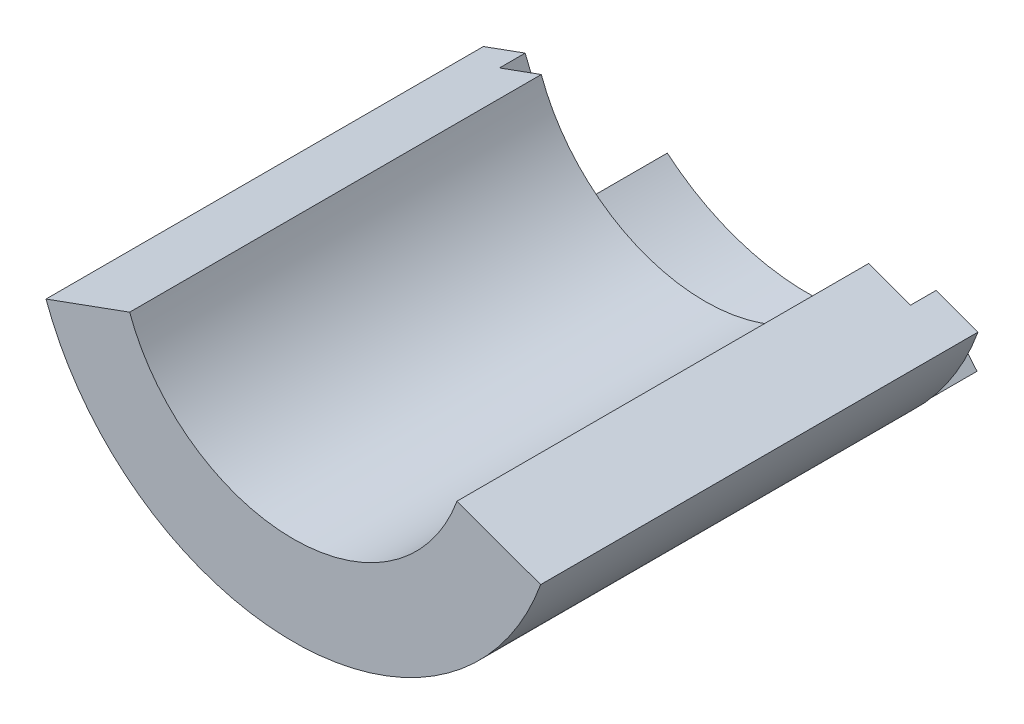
ISO-10303-21;
HEADER;
FILE_DESCRIPTION(('STEP AP214'),'2;1');
FILE_NAME('part.step','',(''),(''),'','','');
FILE_SCHEMA(('AUTOMOTIVE_DESIGN { 1 0 10303 214 1 1 1 1 }'));
ENDSEC;
DATA;
#1=APPLICATION_CONTEXT('core data for automotive mechanical design processes');
#2=APPLICATION_PROTOCOL_DEFINITION('international standard','automotive_design',2000,#1);
#3=PRODUCT_CONTEXT('',#1,'mechanical');
#4=PRODUCT('Part','Part','',(#3));
#5=PRODUCT_RELATED_PRODUCT_CATEGORY('part','',(#4));
#6=PRODUCT_DEFINITION_FORMATION('','',#4);
#7=PRODUCT_DEFINITION_CONTEXT('part definition',#1,'design');
#8=PRODUCT_DEFINITION('design','',#6,#7);
#9=PRODUCT_DEFINITION_SHAPE('','',#8);
#10=(LENGTH_UNIT() NAMED_UNIT(*) SI_UNIT(.MILLI.,.METRE.));
#11=(NAMED_UNIT(*) PLANE_ANGLE_UNIT() SI_UNIT($,.RADIAN.));
#12=(NAMED_UNIT(*) SI_UNIT($,.STERADIAN.) SOLID_ANGLE_UNIT());
#13=UNCERTAINTY_MEASURE_WITH_UNIT(LENGTH_MEASURE(1.E-05),#10,'distance_accuracy_value','');
#14=(GEOMETRIC_REPRESENTATION_CONTEXT(3) GLOBAL_UNCERTAINTY_ASSIGNED_CONTEXT((#13)) GLOBAL_UNIT_ASSIGNED_CONTEXT((#10,
#11,#12)) REPRESENTATION_CONTEXT('',''));
#15=CARTESIAN_POINT('',(0.,0.,0.));
#16=DIRECTION('',(0.,0.,1.));
#17=DIRECTION('',(1.,0.,0.));
#18=AXIS2_PLACEMENT_3D('',#15,#16,#17);
#19=CARTESIAN_POINT('',(0.,0.,3.));
#20=DIRECTION('',(0.,0.,-1.));
#21=DIRECTION('',(-1.,0.,0.));
#22=AXIS2_PLACEMENT_3D('',#19,#20,#21);
#23=CYLINDRICAL_SURFACE('',#22,6.77);
#24=CARTESIAN_POINT('',(0.,0.,4.));
#25=DIRECTION('',(0.,0.,-1.));
#26=DIRECTION('',(-1.,0.,0.));
#27=AXIS2_PLACEMENT_3D('',#24,#25,#26);
#28=CIRCLE('',#27,6.77);
#29=CARTESIAN_POINT('',(-6.3617190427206,-2.31547637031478,4.));
#30=VERTEX_POINT('',#29);
#31=CARTESIAN_POINT('',(6.36171904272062,-2.31547637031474,4.));
#32=VERTEX_POINT('',#31);
#33=EDGE_CURVE('E60',#30,#32,#28,.F.);
#34=ORIENTED_EDGE('',*,*,#33,.F.);
#35=DIRECTION('',(0.,0.,-1.));
#36=VECTOR('',#35,1.);
#37=CARTESIAN_POINT('',(-6.3617190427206,-2.31547637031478,20.));
#38=LINE('',#37,#36);
#39=CARTESIAN_POINT('',(-6.3617190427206,-2.31547637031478,20.));
#40=VERTEX_POINT('',#39);
#41=EDGE_CURVE('E176',#40,#30,#38,.T.);
#42=ORIENTED_EDGE('',*,*,#41,.F.);
#43=CARTESIAN_POINT('',(0.,0.,20.));
#44=DIRECTION('',(0.,0.,-1.));
#45=DIRECTION('',(1.,0.,0.));
#46=AXIS2_PLACEMENT_3D('',#43,#44,#45);
#47=CIRCLE('',#46,6.77);
#48=CARTESIAN_POINT('',(6.36171904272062,-2.31547637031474,20.));
#49=VERTEX_POINT('',#48);
#50=EDGE_CURVE('E154',#49,#40,#47,.T.);
#51=ORIENTED_EDGE('',*,*,#50,.F.);
#52=DIRECTION('',(0.,0.,-1.));
#53=VECTOR('',#52,1.);
#54=CARTESIAN_POINT('',(6.36171904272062,-2.31547637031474,20.));
#55=LINE('',#54,#53);
#56=EDGE_CURVE('E166',#49,#32,#55,.T.);
#57=ORIENTED_EDGE('',*,*,#56,.T.);
#58=EDGE_LOOP('',(#34,#42,#51,#57));
#59=FACE_BOUND('',#58,.T.);
#60=ADVANCED_FACE('F45',(#59),#23,.F.);
#61=CARTESIAN_POINT('',(-4.35167211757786,-5.18612087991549,3.));
#62=DIRECTION('',(0.766044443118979,-0.642787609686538,0.));
#63=DIRECTION('',(0.642787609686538,0.76604444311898,0.));
#64=AXIS2_PLACEMENT_3D('',#61,#62,#63);
#65=PLANE('',#64);
#66=DIRECTION('',(0.,0.,1.));
#67=VECTOR('',#66,1.);
#68=CARTESIAN_POINT('',(-5.46369468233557,-6.51137776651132,0.));
#69=LINE('',#68,#67);
#70=CARTESIAN_POINT('',(-5.46369468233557,-6.51137776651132,0.));
#71=VERTEX_POINT('',#70);
#72=CARTESIAN_POINT('',(-5.46369468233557,-6.51137776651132,3.));
#73=VERTEX_POINT('',#72);
#74=EDGE_CURVE('E186',#71,#73,#69,.T.);
#75=ORIENTED_EDGE('',*,*,#74,.F.);
#76=DIRECTION('',(-0.642787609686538,-0.766044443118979,0.));
#77=VECTOR('',#76,1.);
#78=CARTESIAN_POINT('',(-4.35167211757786,-5.18612087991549,0.));
#79=LINE('',#78,#77);
#80=CARTESIAN_POINT('',(-6.57571724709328,-7.83663465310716,0.));
#81=VERTEX_POINT('',#80);
#82=EDGE_CURVE('E91',#71,#81,#79,.T.);
#83=ORIENTED_EDGE('',*,*,#82,.T.);
#84=DIRECTION('',(0.,0.,-1.));
#85=VECTOR('',#84,1.);
#86=CARTESIAN_POINT('',(-6.57571724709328,-7.83663465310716,3.));
#87=LINE('',#86,#85);
#88=CARTESIAN_POINT('',(-6.57571724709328,-7.83663465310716,3.));
#89=VERTEX_POINT('',#88);
#90=EDGE_CURVE('E85',#89,#81,#87,.T.);
#91=ORIENTED_EDGE('',*,*,#90,.F.);
#92=DIRECTION('',(-0.642787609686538,-0.766044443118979,0.));
#93=VECTOR('',#92,1.);
#94=CARTESIAN_POINT('',(-4.35167211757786,-5.18612087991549,3.));
#95=LINE('',#94,#93);
#96=EDGE_CURVE('E108',#73,#89,#95,.T.);
#97=ORIENTED_EDGE('',*,*,#96,.F.);
#98=EDGE_LOOP('',(#75,#83,#91,#97));
#99=FACE_BOUND('',#98,.T.);
#100=ADVANCED_FACE('F184',(#99),#65,.F.);
#101=CARTESIAN_POINT('',(4.3516721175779,-5.18612087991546,3.));
#102=DIRECTION('',(-0.766044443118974,-0.642787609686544,0.));
#103=DIRECTION('',(0.642787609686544,-0.766044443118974,0.));
#104=AXIS2_PLACEMENT_3D('',#101,#102,#103);
#105=PLANE('',#104);
#106=DIRECTION('',(0.,0.,1.));
#107=VECTOR('',#106,1.);
#108=CARTESIAN_POINT('',(5.46369468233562,-6.51137776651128,0.));
#109=LINE('',#108,#107);
#110=CARTESIAN_POINT('',(5.46369468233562,-6.51137776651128,3.));
#111=VERTEX_POINT('',#110);
#112=CARTESIAN_POINT('',(5.46369468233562,-6.51137776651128,0.));
#113=VERTEX_POINT('',#112);
#114=EDGE_CURVE('E233',#111,#113,#109,.F.);
#115=ORIENTED_EDGE('',*,*,#114,.F.);
#116=DIRECTION('',(-0.642787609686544,0.766044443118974,0.));
#117=VECTOR('',#116,1.);
#118=CARTESIAN_POINT('',(4.3516721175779,-5.18612087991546,3.));
#119=LINE('',#118,#117);
#120=CARTESIAN_POINT('',(6.57571724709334,-7.83663465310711,3.));
#121=VERTEX_POINT('',#120);
#122=EDGE_CURVE('E99',#121,#111,#119,.T.);
#123=ORIENTED_EDGE('',*,*,#122,.F.);
#124=DIRECTION('',(0.,0.,-1.));
#125=VECTOR('',#124,1.);
#126=CARTESIAN_POINT('',(6.57571724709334,-7.83663465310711,3.));
#127=LINE('',#126,#125);
#128=CARTESIAN_POINT('',(6.57571724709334,-7.83663465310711,0.));
#129=VERTEX_POINT('',#128);
#130=EDGE_CURVE('E69',#121,#129,#127,.T.);
#131=ORIENTED_EDGE('',*,*,#130,.T.);
#132=DIRECTION('',(-0.642787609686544,0.766044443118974,0.));
#133=VECTOR('',#132,1.);
#134=CARTESIAN_POINT('',(4.3516721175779,-5.18612087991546,0.));
#135=LINE('',#134,#133);
#136=EDGE_CURVE('E90',#129,#113,#135,.T.);
#137=ORIENTED_EDGE('',*,*,#136,.T.);
#138=EDGE_LOOP('',(#115,#123,#131,#137));
#139=FACE_BOUND('',#138,.T.);
#140=ADVANCED_FACE('F96',(#139),#105,.F.);
#141=CARTESIAN_POINT('',(-6.3617190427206,-2.31547637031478,20.));
#142=DIRECTION('',(0.34202014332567,-0.939692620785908,0.));
#143=DIRECTION('',(0.939692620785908,0.34202014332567,0.));
#144=AXIS2_PLACEMENT_3D('',#141,#142,#143);
#145=PLANE('',#144);
#146=DIRECTION('',(0.,0.,1.));
#147=VECTOR('',#146,1.);
#148=CARTESIAN_POINT('',(-7.98738727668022,-2.90717121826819,0.));
#149=LINE('',#148,#147);
#150=CARTESIAN_POINT('',(-7.98738727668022,-2.90717121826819,3.));
#151=VERTEX_POINT('',#150);
#152=CARTESIAN_POINT('',(-7.98738727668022,-2.90717121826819,4.));
#153=VERTEX_POINT('',#152);
#154=EDGE_CURVE('E137',#151,#153,#149,.T.);
#155=ORIENTED_EDGE('',*,*,#154,.F.);
#156=DIRECTION('',(-0.939692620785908,-0.34202014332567,0.));
#157=VECTOR('',#156,1.);
#158=CARTESIAN_POINT('',(-6.3617190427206,-2.31547637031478,3.));
#159=LINE('',#158,#157);
#160=CARTESIAN_POINT('',(-9.61305551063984,-3.4988660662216,3.));
#161=VERTEX_POINT('',#160);
#162=EDGE_CURVE('E213',#151,#161,#159,.T.);
#163=ORIENTED_EDGE('',*,*,#162,.T.);
#164=DIRECTION('',(0.,0.,-1.));
#165=VECTOR('',#164,1.);
#166=CARTESIAN_POINT('',(-9.61305551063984,-3.4988660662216,20.));
#167=LINE('',#166,#165);
#168=CARTESIAN_POINT('',(-9.61305551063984,-3.4988660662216,20.));
#169=VERTEX_POINT('',#168);
#170=EDGE_CURVE('E172',#169,#161,#167,.T.);
#171=ORIENTED_EDGE('',*,*,#170,.F.);
#172=DIRECTION('',(-0.939692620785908,-0.34202014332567,0.));
#173=VECTOR('',#172,1.);
#174=CARTESIAN_POINT('',(-6.3617190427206,-2.31547637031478,20.));
#175=LINE('',#174,#173);
#176=EDGE_CURVE('E160',#40,#169,#175,.T.);
#177=ORIENTED_EDGE('',*,*,#176,.F.);
#178=ORIENTED_EDGE('',*,*,#41,.T.);
#179=DIRECTION('',(0.939692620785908,0.34202014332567,0.));
#180=VECTOR('',#179,1.);
#181=CARTESIAN_POINT('',(-6.3617190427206,-2.31547637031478,4.));
#182=LINE('',#181,#180);
#183=EDGE_CURVE('E239',#153,#30,#182,.T.);
#184=ORIENTED_EDGE('',*,*,#183,.F.);
#185=EDGE_LOOP('',(#155,#163,#171,#177,#178,#184));
#186=FACE_BOUND('',#185,.T.);
#187=ADVANCED_FACE('F248',(#186),#145,.F.);
#188=CARTESIAN_POINT('',(6.36171904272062,-2.31547637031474,20.));
#189=DIRECTION('',(-0.342020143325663,-0.939692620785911,0.));
#190=DIRECTION('',(0.939692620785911,-0.342020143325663,0.));
#191=AXIS2_PLACEMENT_3D('',#188,#189,#190);
#192=PLANE('',#191);
#193=DIRECTION('',(0.,0.,1.));
#194=VECTOR('',#193,1.);
#195=CARTESIAN_POINT('',(7.98738727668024,-2.90717121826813,0.));
#196=LINE('',#195,#194);
#197=CARTESIAN_POINT('',(7.98738727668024,-2.90717121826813,4.));
#198=VERTEX_POINT('',#197);
#199=CARTESIAN_POINT('',(7.98738727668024,-2.90717121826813,3.));
#200=VERTEX_POINT('',#199);
#201=EDGE_CURVE('E11',#198,#200,#196,.F.);
#202=ORIENTED_EDGE('',*,*,#201,.F.);
#203=DIRECTION('',(0.939692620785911,-0.342020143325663,0.));
#204=VECTOR('',#203,1.);
#205=CARTESIAN_POINT('',(6.36171904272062,-2.31547637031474,4.));
#206=LINE('',#205,#204);
#207=EDGE_CURVE('E53',#32,#198,#206,.T.);
#208=ORIENTED_EDGE('',*,*,#207,.F.);
#209=ORIENTED_EDGE('',*,*,#56,.F.);
#210=DIRECTION('',(-0.93969262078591,0.342020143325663,0.));
#211=VECTOR('',#210,1.);
#212=CARTESIAN_POINT('',(6.36171904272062,-2.31547637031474,20.));
#213=LINE('',#212,#211);
#214=CARTESIAN_POINT('',(9.61305551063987,-3.49886606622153,20.));
#215=VERTEX_POINT('',#214);
#216=EDGE_CURVE('E169',#215,#49,#213,.T.);
#217=ORIENTED_EDGE('',*,*,#216,.F.);
#218=DIRECTION('',(0.,0.,-1.));
#219=VECTOR('',#218,1.);
#220=CARTESIAN_POINT('',(9.61305551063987,-3.49886606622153,20.));
#221=LINE('',#220,#219);
#222=CARTESIAN_POINT('',(9.61305551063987,-3.49886606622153,3.));
#223=VERTEX_POINT('',#222);
#224=EDGE_CURVE('E148',#215,#223,#221,.T.);
#225=ORIENTED_EDGE('',*,*,#224,.T.);
#226=DIRECTION('',(-0.93969262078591,0.342020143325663,0.));
#227=VECTOR('',#226,1.);
#228=CARTESIAN_POINT('',(6.36171904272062,-2.31547637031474,3.));
#229=LINE('',#228,#227);
#230=EDGE_CURVE('E144',#223,#200,#229,.T.);
#231=ORIENTED_EDGE('',*,*,#230,.T.);
#232=EDGE_LOOP('',(#202,#208,#209,#217,#225,#231));
#233=FACE_BOUND('',#232,.T.);
#234=ADVANCED_FACE('F141',(#233),#192,.F.);
#235=CARTESIAN_POINT('',(0.,0.,3.));
#236=DIRECTION('',(0.,0.,-1.));
#237=DIRECTION('',(-1.,0.,0.));
#238=AXIS2_PLACEMENT_3D('',#235,#236,#237);
#239=CYLINDRICAL_SURFACE('',#238,10.23);
#240=CARTESIAN_POINT('',(0.,0.,0.));
#241=DIRECTION('',(0.,0.,1.));
#242=DIRECTION('',(1.,0.,0.));
#243=AXIS2_PLACEMENT_3D('',#240,#241,#242);
#244=CIRCLE('',#243,10.23);
#245=EDGE_CURVE('E81',#81,#129,#244,.T.);
#246=ORIENTED_EDGE('',*,*,#245,.T.);
#247=ORIENTED_EDGE('',*,*,#130,.F.);
#248=CARTESIAN_POINT('',(0.,0.,3.));
#249=DIRECTION('',(0.,0.,1.));
#250=DIRECTION('',(1.,0.,0.));
#251=AXIS2_PLACEMENT_3D('',#248,#249,#250);
#252=CIRCLE('',#251,10.23);
#253=EDGE_CURVE('E162',#121,#223,#252,.T.);
#254=ORIENTED_EDGE('',*,*,#253,.T.);
#255=ORIENTED_EDGE('',*,*,#224,.F.);
#256=CARTESIAN_POINT('',(0.,0.,20.));
#257=DIRECTION('',(0.,0.,1.));
#258=DIRECTION('',(1.,0.,0.));
#259=AXIS2_PLACEMENT_3D('',#256,#257,#258);
#260=CIRCLE('',#259,10.23);
#261=EDGE_CURVE('E224',#169,#215,#260,.T.);
#262=ORIENTED_EDGE('',*,*,#261,.F.);
#263=ORIENTED_EDGE('',*,*,#170,.T.);
#264=EDGE_CURVE('E155',#161,#89,#252,.T.);
#265=ORIENTED_EDGE('',*,*,#264,.T.);
#266=ORIENTED_EDGE('',*,*,#90,.T.);
#267=EDGE_LOOP('',(#246,#247,#254,#255,#262,#263,#265,#266));
#268=FACE_BOUND('',#267,.T.);
#269=ADVANCED_FACE('F82',(#268),#239,.T.);
#270=CARTESIAN_POINT('',(0.,0.,0.));
#271=DIRECTION('',(0.,0.,1.));
#272=DIRECTION('',(1.,0.,0.));
#273=AXIS2_PLACEMENT_3D('',#270,#271,#272);
#274=PLANE('',#273);
#275=CARTESIAN_POINT('',(0.,0.,0.));
#276=DIRECTION('',(0.,0.,-1.));
#277=DIRECTION('',(-1.,0.,0.));
#278=AXIS2_PLACEMENT_3D('',#275,#276,#277);
#279=CIRCLE('',#278,8.5);
#280=EDGE_CURVE('E106',#113,#71,#279,.T.);
#281=ORIENTED_EDGE('',*,*,#280,.F.);
#282=ORIENTED_EDGE('',*,*,#136,.F.);
#283=ORIENTED_EDGE('',*,*,#245,.F.);
#284=ORIENTED_EDGE('',*,*,#82,.F.);
#285=EDGE_LOOP('',(#281,#282,#283,#284));
#286=FACE_BOUND('',#285,.T.);
#287=ADVANCED_FACE('F104',(#286),#274,.F.);
#288=CARTESIAN_POINT('',(0.,0.,3.));
#289=DIRECTION('',(0.,0.,1.));
#290=DIRECTION('',(1.,0.,0.));
#291=AXIS2_PLACEMENT_3D('',#288,#289,#290);
#292=PLANE('',#291);
#293=CARTESIAN_POINT('',(0.,0.,3.));
#294=DIRECTION('',(0.,0.,1.));
#295=DIRECTION('',(1.,0.,0.));
#296=AXIS2_PLACEMENT_3D('',#293,#294,#295);
#297=CIRCLE('',#296,8.5);
#298=EDGE_CURVE('E219',#73,#151,#297,.F.);
#299=ORIENTED_EDGE('',*,*,#298,.F.);
#300=ORIENTED_EDGE('',*,*,#96,.T.);
#301=ORIENTED_EDGE('',*,*,#264,.F.);
#302=ORIENTED_EDGE('',*,*,#162,.F.);
#303=EDGE_LOOP('',(#299,#300,#301,#302));
#304=FACE_BOUND('',#303,.T.);
#305=ADVANCED_FACE('F254',(#304),#292,.F.);
#306=CARTESIAN_POINT('',(0.,0.,3.));
#307=DIRECTION('',(0.,0.,1.));
#308=DIRECTION('',(1.,0.,0.));
#309=AXIS2_PLACEMENT_3D('',#306,#307,#308);
#310=CIRCLE('',#309,8.5);
#311=EDGE_CURVE('E236',#200,#111,#310,.F.);
#312=ORIENTED_EDGE('',*,*,#311,.F.);
#313=ORIENTED_EDGE('',*,*,#230,.F.);
#314=ORIENTED_EDGE('',*,*,#253,.F.);
#315=ORIENTED_EDGE('',*,*,#122,.T.);
#316=EDGE_LOOP('',(#312,#313,#314,#315));
#317=FACE_BOUND('',#316,.T.);
#318=ADVANCED_FACE('F256',(#317),#292,.F.);
#319=CARTESIAN_POINT('',(0.,0.,20.));
#320=DIRECTION('',(0.,0.,1.));
#321=DIRECTION('',(1.,0.,0.));
#322=AXIS2_PLACEMENT_3D('',#319,#320,#321);
#323=PLANE('',#322);
#324=ORIENTED_EDGE('',*,*,#50,.T.);
#325=ORIENTED_EDGE('',*,*,#176,.T.);
#326=ORIENTED_EDGE('',*,*,#261,.T.);
#327=ORIENTED_EDGE('',*,*,#216,.T.);
#328=EDGE_LOOP('',(#324,#325,#326,#327));
#329=FACE_BOUND('',#328,.T.);
#330=ADVANCED_FACE('F250',(#329),#323,.T.);
#331=CARTESIAN_POINT('',(0.,0.,0.));
#332=DIRECTION('',(0.,0.,1.));
#333=DIRECTION('',(1.,0.,0.));
#334=AXIS2_PLACEMENT_3D('',#331,#332,#333);
#335=CYLINDRICAL_SURFACE('',#334,8.5);
#336=ORIENTED_EDGE('',*,*,#74,.T.);
#337=ORIENTED_EDGE('',*,*,#298,.T.);
#338=ORIENTED_EDGE('',*,*,#154,.T.);
#339=CARTESIAN_POINT('',(0.,0.,4.));
#340=DIRECTION('',(0.,0.,-1.));
#341=DIRECTION('',(-1.,0.,0.));
#342=AXIS2_PLACEMENT_3D('',#339,#340,#341);
#343=CIRCLE('',#342,8.5);
#344=EDGE_CURVE('E121',#198,#153,#343,.T.);
#345=ORIENTED_EDGE('',*,*,#344,.F.);
#346=ORIENTED_EDGE('',*,*,#201,.T.);
#347=ORIENTED_EDGE('',*,*,#311,.T.);
#348=ORIENTED_EDGE('',*,*,#114,.T.);
#349=ORIENTED_EDGE('',*,*,#280,.T.);
#350=EDGE_LOOP('',(#336,#337,#338,#345,#346,#347,#348,#349));
#351=FACE_BOUND('',#350,.T.);
#352=ADVANCED_FACE('F131',(#351),#335,.F.);
#353=CARTESIAN_POINT('',(0.,0.,4.));
#354=DIRECTION('',(0.,0.,-1.));
#355=DIRECTION('',(-1.,0.,0.));
#356=AXIS2_PLACEMENT_3D('',#353,#354,#355);
#357=PLANE('',#356);
#358=ORIENTED_EDGE('',*,*,#183,.T.);
#359=ORIENTED_EDGE('',*,*,#33,.T.);
#360=ORIENTED_EDGE('',*,*,#207,.T.);
#361=ORIENTED_EDGE('',*,*,#344,.T.);
#362=EDGE_LOOP('',(#358,#359,#360,#361));
#363=FACE_BOUND('',#362,.T.);
#364=ADVANCED_FACE('F119',(#363),#357,.T.);
#365=CLOSED_SHELL('',(#60,#100,#140,#187,#234,#269,#287,#305,#318,#330,#352,#364));
#366=MANIFOLD_SOLID_BREP('B2',#365);
#367=ADVANCED_BREP_SHAPE_REPRESENTATION('',(#18,#366),#14);
#368=SHAPE_DEFINITION_REPRESENTATION(#9,#367);
ENDSEC;
END-ISO-10303-21;
